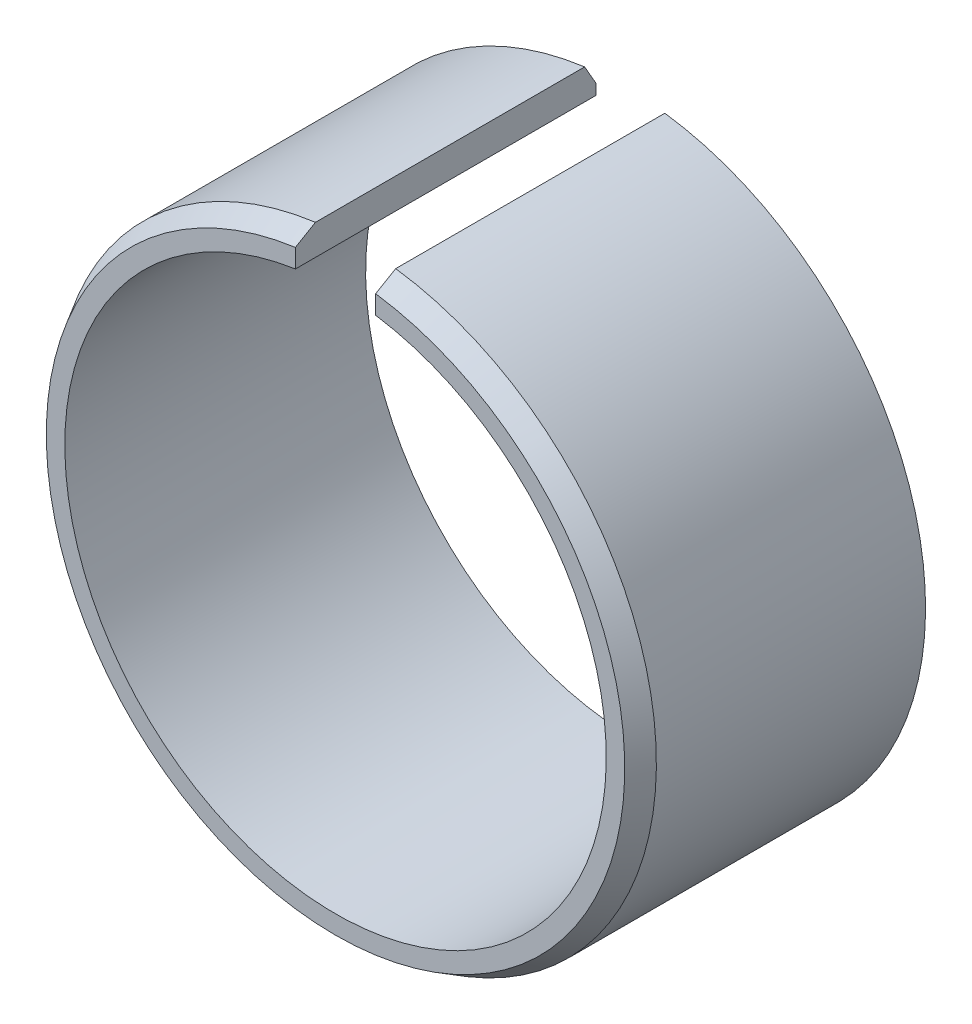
ISO-10303-21;
HEADER;
FILE_DESCRIPTION(('STEP AP214'),'2;1');
FILE_NAME('part.step','',(''),(''),'','','');
FILE_SCHEMA(('AUTOMOTIVE_DESIGN { 1 0 10303 214 1 1 1 1 }'));
ENDSEC;
DATA;
#1=APPLICATION_CONTEXT('core data for automotive mechanical design processes');
#2=APPLICATION_PROTOCOL_DEFINITION('international standard','automotive_design',2000,#1);
#3=PRODUCT_CONTEXT('',#1,'mechanical');
#4=PRODUCT('Part','Part','',(#3));
#5=PRODUCT_RELATED_PRODUCT_CATEGORY('part','',(#4));
#6=PRODUCT_DEFINITION_FORMATION('','',#4);
#7=PRODUCT_DEFINITION_CONTEXT('part definition',#1,'design');
#8=PRODUCT_DEFINITION('design','',#6,#7);
#9=PRODUCT_DEFINITION_SHAPE('','',#8);
#10=(LENGTH_UNIT() NAMED_UNIT(*) SI_UNIT(.MILLI.,.METRE.));
#11=(NAMED_UNIT(*) PLANE_ANGLE_UNIT() SI_UNIT($,.RADIAN.));
#12=(NAMED_UNIT(*) SI_UNIT($,.STERADIAN.) SOLID_ANGLE_UNIT());
#13=UNCERTAINTY_MEASURE_WITH_UNIT(LENGTH_MEASURE(1.E-05),#10,'distance_accuracy_value','');
#14=(GEOMETRIC_REPRESENTATION_CONTEXT(3) GLOBAL_UNCERTAINTY_ASSIGNED_CONTEXT((#13)) GLOBAL_UNIT_ASSIGNED_CONTEXT((#10,
#11,#12)) REPRESENTATION_CONTEXT('',''));
#15=CARTESIAN_POINT('',(0.,0.,0.));
#16=DIRECTION('',(0.,0.,1.));
#17=DIRECTION('',(1.,0.,0.));
#18=AXIS2_PLACEMENT_3D('',#15,#16,#17);
#19=CARTESIAN_POINT('',(0.,0.,15.));
#20=DIRECTION('',(0.,0.,-1.));
#21=DIRECTION('',(-1.,0.,0.));
#22=AXIS2_PLACEMENT_3D('',#19,#20,#21);
#23=CYLINDRICAL_SURFACE('',#22,15.);
#24=DIRECTION('',(0.,0.,-1.));
#25=VECTOR('',#24,1.);
#26=CARTESIAN_POINT('',(2.,14.8660687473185,15.));
#27=LINE('',#26,#25);
#28=CARTESIAN_POINT('',(2.,14.8660687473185,14.));
#29=VERTEX_POINT('',#28);
#30=CARTESIAN_POINT('',(2.,14.8660687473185,0.577350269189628));
#31=VERTEX_POINT('',#30);
#32=EDGE_CURVE('E102',#29,#31,#27,.T.);
#33=ORIENTED_EDGE('',*,*,#32,.F.);
#34=CARTESIAN_POINT('',(0.,0.,14.));
#35=DIRECTION('',(0.,0.,1.));
#36=DIRECTION('',(1.,0.,0.));
#37=AXIS2_PLACEMENT_3D('',#34,#35,#36);
#38=CIRCLE('',#37,15.);
#39=CARTESIAN_POINT('',(-2.,14.8660687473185,14.));
#40=VERTEX_POINT('',#39);
#41=EDGE_CURVE('E175',#29,#40,#38,.F.);
#42=ORIENTED_EDGE('',*,*,#41,.T.);
#43=DIRECTION('',(0.,0.,-1.));
#44=VECTOR('',#43,1.);
#45=CARTESIAN_POINT('',(-2.,14.8660687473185,15.));
#46=LINE('',#45,#44);
#47=CARTESIAN_POINT('',(-2.,14.8660687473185,0.577350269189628));
#48=VERTEX_POINT('',#47);
#49=EDGE_CURVE('E116',#40,#48,#46,.T.);
#50=ORIENTED_EDGE('',*,*,#49,.T.);
#51=CARTESIAN_POINT('',(0.,0.,0.577350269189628));
#52=DIRECTION('',(0.,0.,1.));
#53=DIRECTION('',(1.,0.,0.));
#54=AXIS2_PLACEMENT_3D('',#51,#52,#53);
#55=CIRCLE('',#54,15.);
#56=EDGE_CURVE('E177',#48,#31,#55,.T.);
#57=ORIENTED_EDGE('',*,*,#56,.T.);
#58=EDGE_LOOP('',(#33,#42,#50,#57));
#59=FACE_BOUND('',#58,.T.);
#60=ADVANCED_FACE('F34',(#59),#23,.T.);
#61=CARTESIAN_POINT('',(2.,14.8660687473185,15.));
#62=DIRECTION('',(1.,0.,0.));
#63=DIRECTION('',(0.,1.,0.));
#64=AXIS2_PLACEMENT_3D('',#61,#62,#63);
#65=PLANE('',#64);
#66=DIRECTION('',(0.,-1.,0.));
#67=VECTOR('',#66,1.);
#68=CARTESIAN_POINT('',(2.,14.8660687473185,15.));
#69=LINE('',#68,#67);
#70=CARTESIAN_POINT('',(2.,14.2833058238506,15.));
#71=VERTEX_POINT('',#70);
#72=CARTESIAN_POINT('',(2.,13.3510299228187,15.));
#73=VERTEX_POINT('',#72);
#74=EDGE_CURVE('E108',#71,#73,#69,.T.);
#75=ORIENTED_EDGE('',*,*,#74,.F.);
#76=CARTESIAN_POINT('',(2.,14.2833058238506,15.));
#77=CARTESIAN_POINT('',(2.,14.3804597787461,14.8333489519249));
#78=CARTESIAN_POINT('',(2.,14.4776003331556,14.6666900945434));
#79=CARTESIAN_POINT('',(2.,14.6718546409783,14.3333567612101));
#80=CARTESIAN_POINT('',(2.,14.7689683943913,14.1666822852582));
#81=CARTESIAN_POINT('',(2.,14.8660687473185,14.));
#82=B_SPLINE_CURVE_WITH_KNOTS('',3,(#76,#77,#78,#79,#80,#81),.UNSPECIFIED.,.F.,.F.,(4,2,4),(0.,
0.578708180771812,1.1574163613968),.UNSPECIFIED.);
#83=EDGE_CURVE('E129',#71,#29,#82,.T.);
#84=ORIENTED_EDGE('',*,*,#83,.T.);
#85=ORIENTED_EDGE('',*,*,#32,.T.);
#86=CARTESIAN_POINT('',(2.,14.8660687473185,0.577350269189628));
#87=CARTESIAN_POINT('',(2.,14.6978194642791,0.481076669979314));
#88=CARTESIAN_POINT('',(2.,14.5295562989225,0.384827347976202));
#89=CARTESIAN_POINT('',(2.,14.1930022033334,0.192377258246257));
#90=CARTESIAN_POINT('',(2.,14.0247112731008,0.0961764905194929));
#91=CARTESIAN_POINT('',(2.,13.856406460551,0.));
#92=B_SPLINE_CURVE_WITH_KNOTS('',3,(#86,#87,#88,#89,#90,#91),.UNSPECIFIED.,.F.,.F.,(4,2,4),(0.,
0.581539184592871,1.16307837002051),.UNSPECIFIED.);
#93=CARTESIAN_POINT('',(2.,13.856406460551,0.));
#94=VERTEX_POINT('',#93);
#95=EDGE_CURVE('E93',#31,#94,#92,.T.);
#96=ORIENTED_EDGE('',*,*,#95,.T.);
#97=DIRECTION('',(0.,-1.,0.));
#98=VECTOR('',#97,1.);
#99=CARTESIAN_POINT('',(2.,14.8660687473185,0.));
#100=LINE('',#99,#98);
#101=CARTESIAN_POINT('',(2.,13.3510299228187,0.));
#102=VERTEX_POINT('',#101);
#103=EDGE_CURVE('E86',#94,#102,#100,.T.);
#104=ORIENTED_EDGE('',*,*,#103,.T.);
#105=DIRECTION('',(0.,0.,-1.));
#106=VECTOR('',#105,1.);
#107=CARTESIAN_POINT('',(2.,13.3510299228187,15.));
#108=LINE('',#107,#106);
#109=EDGE_CURVE('E90',#73,#102,#108,.T.);
#110=ORIENTED_EDGE('',*,*,#109,.F.);
#111=EDGE_LOOP('',(#75,#84,#85,#96,#104,#110));
#112=FACE_BOUND('',#111,.T.);
#113=ADVANCED_FACE('F89',(#112),#65,.F.);
#114=CARTESIAN_POINT('',(0.,0.,15.));
#115=DIRECTION('',(0.,0.,-1.));
#116=DIRECTION('',(-1.,0.,0.));
#117=AXIS2_PLACEMENT_3D('',#114,#115,#116);
#118=CYLINDRICAL_SURFACE('',#117,13.5);
#119=CARTESIAN_POINT('',(0.,0.,0.));
#120=DIRECTION('',(0.,0.,-1.));
#121=DIRECTION('',(1.,0.,0.));
#122=AXIS2_PLACEMENT_3D('',#119,#120,#121);
#123=CIRCLE('',#122,13.5);
#124=CARTESIAN_POINT('',(-2.,13.3510299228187,0.));
#125=VERTEX_POINT('',#124);
#126=EDGE_CURVE('E95',#102,#125,#123,.T.);
#127=ORIENTED_EDGE('',*,*,#126,.T.);
#128=DIRECTION('',(0.,0.,-1.));
#129=VECTOR('',#128,1.);
#130=CARTESIAN_POINT('',(-2.,13.3510299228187,15.));
#131=LINE('',#130,#129);
#132=CARTESIAN_POINT('',(-2.,13.3510299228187,15.));
#133=VERTEX_POINT('',#132);
#134=EDGE_CURVE('E103',#133,#125,#131,.T.);
#135=ORIENTED_EDGE('',*,*,#134,.F.);
#136=CARTESIAN_POINT('',(0.,0.,15.));
#137=DIRECTION('',(0.,0.,-1.));
#138=DIRECTION('',(1.,0.,0.));
#139=AXIS2_PLACEMENT_3D('',#136,#137,#138);
#140=CIRCLE('',#139,13.5);
#141=EDGE_CURVE('E101',#73,#133,#140,.T.);
#142=ORIENTED_EDGE('',*,*,#141,.F.);
#143=ORIENTED_EDGE('',*,*,#109,.T.);
#144=EDGE_LOOP('',(#127,#135,#142,#143));
#145=FACE_BOUND('',#144,.T.);
#146=ADVANCED_FACE('F98',(#145),#118,.F.);
#147=CARTESIAN_POINT('',(-2.,14.8660687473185,15.));
#148=DIRECTION('',(-1.,0.,0.));
#149=DIRECTION('',(0.,-1.,0.));
#150=AXIS2_PLACEMENT_3D('',#147,#148,#149);
#151=PLANE('',#150);
#152=ORIENTED_EDGE('',*,*,#49,.F.);
#153=CARTESIAN_POINT('',(-2.,14.8660687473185,14.));
#154=CARTESIAN_POINT('',(-2.,14.7689683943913,14.1666822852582));
#155=CARTESIAN_POINT('',(-2.,14.6718546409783,14.3333567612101));
#156=CARTESIAN_POINT('',(-2.,14.4776003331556,14.6666900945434));
#157=CARTESIAN_POINT('',(-2.,14.3804597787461,14.8333489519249));
#158=CARTESIAN_POINT('',(-2.,14.2833058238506,15.));
#159=B_SPLINE_CURVE_WITH_KNOTS('',3,(#153,#154,#155,#156,#157,#158),.UNSPECIFIED.,.F.,.F.,(4,2,
4),(0.,0.578708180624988,1.1574163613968),.UNSPECIFIED.);
#160=CARTESIAN_POINT('',(-2.,14.2833058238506,15.));
#161=VERTEX_POINT('',#160);
#162=EDGE_CURVE('E41',#40,#161,#159,.T.);
#163=ORIENTED_EDGE('',*,*,#162,.T.);
#164=DIRECTION('',(0.,1.,0.));
#165=VECTOR('',#164,1.);
#166=CARTESIAN_POINT('',(-2.,14.8660687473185,15.));
#167=LINE('',#166,#165);
#168=EDGE_CURVE('E113',#133,#161,#167,.T.);
#169=ORIENTED_EDGE('',*,*,#168,.F.);
#170=ORIENTED_EDGE('',*,*,#134,.T.);
#171=DIRECTION('',(0.,1.,0.));
#172=VECTOR('',#171,1.);
#173=CARTESIAN_POINT('',(-2.,14.8660687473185,0.));
#174=LINE('',#173,#172);
#175=CARTESIAN_POINT('',(-2.,13.856406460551,0.));
#176=VERTEX_POINT('',#175);
#177=EDGE_CURVE('E106',#125,#176,#174,.T.);
#178=ORIENTED_EDGE('',*,*,#177,.T.);
#179=CARTESIAN_POINT('',(-2.,13.856406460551,0.));
#180=CARTESIAN_POINT('',(-2.,14.0247112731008,0.0961764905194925));
#181=CARTESIAN_POINT('',(-2.,14.1930022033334,0.192377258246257));
#182=CARTESIAN_POINT('',(-2.,14.5295562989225,0.384827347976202));
#183=CARTESIAN_POINT('',(-2.,14.6978194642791,0.481076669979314));
#184=CARTESIAN_POINT('',(-2.,14.8660687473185,0.577350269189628));
#185=B_SPLINE_CURVE_WITH_KNOTS('',3,(#179,#180,#181,#182,#183,#184),.UNSPECIFIED.,.F.,.F.,(4,2,
4),(0.,0.581539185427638,1.16307837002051),.UNSPECIFIED.);
#186=EDGE_CURVE('E53',#176,#48,#185,.T.);
#187=ORIENTED_EDGE('',*,*,#186,.T.);
#188=EDGE_LOOP('',(#152,#163,#169,#170,#178,#187));
#189=FACE_BOUND('',#188,.T.);
#190=ADVANCED_FACE('F143',(#189),#151,.F.);
#191=CARTESIAN_POINT('',(0.,0.,15.));
#192=DIRECTION('',(0.,0.,1.));
#193=DIRECTION('',(1.,0.,0.));
#194=AXIS2_PLACEMENT_3D('',#191,#192,#193);
#195=PLANE('',#194);
#196=ORIENTED_EDGE('',*,*,#168,.T.);
#197=CARTESIAN_POINT('',(0.,0.,15.));
#198=DIRECTION('',(0.,0.,1.));
#199=DIRECTION('',(1.,0.,0.));
#200=AXIS2_PLACEMENT_3D('',#197,#198,#199);
#201=CIRCLE('',#200,14.4226497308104);
#202=EDGE_CURVE('E121',#161,#71,#201,.T.);
#203=ORIENTED_EDGE('',*,*,#202,.T.);
#204=ORIENTED_EDGE('',*,*,#74,.T.);
#205=ORIENTED_EDGE('',*,*,#141,.T.);
#206=EDGE_LOOP('',(#196,#203,#204,#205));
#207=FACE_BOUND('',#206,.T.);
#208=ADVANCED_FACE('F147',(#207),#195,.T.);
#209=CARTESIAN_POINT('',(0.,0.,0.));
#210=DIRECTION('',(0.,0.,1.));
#211=DIRECTION('',(1.,0.,0.));
#212=AXIS2_PLACEMENT_3D('',#209,#210,#211);
#213=PLANE('',#212);
#214=ORIENTED_EDGE('',*,*,#103,.F.);
#215=CARTESIAN_POINT('',(0.,0.,0.));
#216=DIRECTION('',(0.,0.,1.));
#217=DIRECTION('',(1.,0.,0.));
#218=AXIS2_PLACEMENT_3D('',#215,#216,#217);
#219=CIRCLE('',#218,14.);
#220=EDGE_CURVE('E11',#94,#176,#219,.F.);
#221=ORIENTED_EDGE('',*,*,#220,.T.);
#222=ORIENTED_EDGE('',*,*,#177,.F.);
#223=ORIENTED_EDGE('',*,*,#126,.F.);
#224=EDGE_LOOP('',(#214,#221,#222,#223));
#225=FACE_BOUND('',#224,.T.);
#226=ADVANCED_FACE('F105',(#225),#213,.F.);
#227=CARTESIAN_POINT('',(0.,0.,15.));
#228=DIRECTION('',(0.,0.,-1.));
#229=DIRECTION('',(-1.,0.,0.));
#230=AXIS2_PLACEMENT_3D('',#227,#228,#229);
#231=CONICAL_SURFACE('',#230,14.4226497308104,0.523598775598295);
#232=ORIENTED_EDGE('',*,*,#162,.F.);
#233=ORIENTED_EDGE('',*,*,#41,.F.);
#234=ORIENTED_EDGE('',*,*,#83,.F.);
#235=ORIENTED_EDGE('',*,*,#202,.F.);
#236=EDGE_LOOP('',(#232,#233,#234,#235));
#237=FACE_BOUND('',#236,.T.);
#238=ADVANCED_FACE('F158',(#237),#231,.T.);
#239=CARTESIAN_POINT('',(0.,0.,0.577350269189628));
#240=DIRECTION('',(0.,0.,1.));
#241=DIRECTION('',(1.,0.,0.));
#242=AXIS2_PLACEMENT_3D('',#239,#240,#241);
#243=CONICAL_SURFACE('',#242,15.,1.0471975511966);
#244=ORIENTED_EDGE('',*,*,#186,.F.);
#245=ORIENTED_EDGE('',*,*,#220,.F.);
#246=ORIENTED_EDGE('',*,*,#95,.F.);
#247=ORIENTED_EDGE('',*,*,#56,.F.);
#248=EDGE_LOOP('',(#244,#245,#246,#247));
#249=FACE_BOUND('',#248,.T.);
#250=ADVANCED_FACE('F135',(#249),#243,.T.);
#251=CLOSED_SHELL('',(#60,#113,#146,#190,#208,#226,#238,#250));
#252=MANIFOLD_SOLID_BREP('B2',#251);
#253=ADVANCED_BREP_SHAPE_REPRESENTATION('',(#18,#252),#14);
#254=SHAPE_DEFINITION_REPRESENTATION(#9,#253);
ENDSEC;
END-ISO-10303-21;
